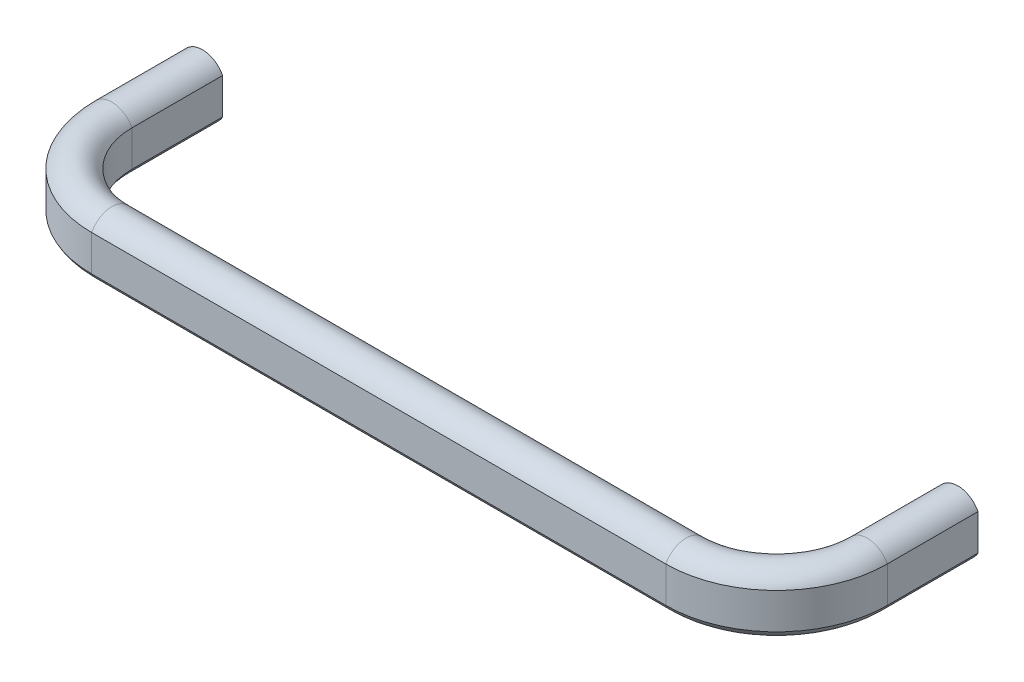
ISO-10303-21;
HEADER;
FILE_DESCRIPTION(('STEP AP214'),'2;1');
FILE_NAME('part.step','',(''),(''),'','','');
FILE_SCHEMA(('AUTOMOTIVE_DESIGN { 1 0 10303 214 1 1 1 1 }'));
ENDSEC;
DATA;
#1=APPLICATION_CONTEXT('core data for automotive mechanical design processes');
#2=APPLICATION_PROTOCOL_DEFINITION('international standard','automotive_design',2000,#1);
#3=PRODUCT_CONTEXT('',#1,'mechanical');
#4=PRODUCT('Part','Part','',(#3));
#5=PRODUCT_RELATED_PRODUCT_CATEGORY('part','',(#4));
#6=PRODUCT_DEFINITION_FORMATION('','',#4);
#7=PRODUCT_DEFINITION_CONTEXT('part definition',#1,'design');
#8=PRODUCT_DEFINITION('design','',#6,#7);
#9=PRODUCT_DEFINITION_SHAPE('','',#8);
#10=(LENGTH_UNIT() NAMED_UNIT(*) SI_UNIT(.MILLI.,.METRE.));
#11=(NAMED_UNIT(*) PLANE_ANGLE_UNIT() SI_UNIT($,.RADIAN.));
#12=(NAMED_UNIT(*) SI_UNIT($,.STERADIAN.) SOLID_ANGLE_UNIT());
#13=UNCERTAINTY_MEASURE_WITH_UNIT(LENGTH_MEASURE(1.E-05),#10,'distance_accuracy_value','');
#14=(GEOMETRIC_REPRESENTATION_CONTEXT(3) GLOBAL_UNCERTAINTY_ASSIGNED_CONTEXT((#13)) GLOBAL_UNIT_ASSIGNED_CONTEXT((#10,
#11,#12)) REPRESENTATION_CONTEXT('',''));
#15=CARTESIAN_POINT('',(0.,0.,0.));
#16=DIRECTION('',(0.,0.,1.));
#17=DIRECTION('',(1.,0.,0.));
#18=AXIS2_PLACEMENT_3D('',#15,#16,#17);
#19=CARTESIAN_POINT('',(149.999999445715,1.49999905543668,0.));
#20=DIRECTION('',(0.,0.,1.));
#21=DIRECTION('',(0.,1.,0.));
#22=AXIS2_PLACEMENT_3D('',#19,#20,#21);
#23=PLANE('',#22);
#24=CARTESIAN_POINT('',(150.,0.,0.));
#25=DIRECTION('',(0.,0.,1.));
#26=DIRECTION('',(1.,0.,0.));
#27=AXIS2_PLACEMENT_3D('',#24,#25,#26);
#28=CIRCLE('',#27,2.95);
#29=CARTESIAN_POINT('',(152.95,0.,0.));
#30=VERTEX_POINT('',#29);
#31=EDGE_CURVE('E236',#30,#30,#28,.T.);
#32=ORIENTED_EDGE('',*,*,#31,.T.);
#33=EDGE_LOOP('',(#32));
#34=FACE_BOUND('',#33,.T.);
#35=CARTESIAN_POINT('',(149.999999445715,1.49999905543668,0.));
#36=DIRECTION('',(0.,0.,1.));
#37=DIRECTION('',(0.,1.,0.));
#38=AXIS2_PLACEMENT_3D('',#35,#36,#37);
#39=CIRCLE('',#38,4.50000000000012);
#40=CARTESIAN_POINT('',(154.,3.56155079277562,0.));
#41=VERTEX_POINT('',#40);
#42=CARTESIAN_POINT('',(145.99999880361,3.56155062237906,0.));
#43=VERTEX_POINT('',#42);
#44=EDGE_CURVE('E209',#41,#43,#39,.T.);
#45=ORIENTED_EDGE('',*,*,#44,.F.);
#46=DIRECTION('',(0.,-1.,0.));
#47=VECTOR('',#46,1.);
#48=CARTESIAN_POINT('',(154.,3.56155079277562,0.));
#49=LINE('',#48,#47);
#50=CARTESIAN_POINT('',(154.,-3.56155431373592,0.));
#51=VERTEX_POINT('',#50);
#52=EDGE_CURVE('E30',#41,#51,#49,.T.);
#53=ORIENTED_EDGE('',*,*,#52,.T.);
#54=CARTESIAN_POINT('',(149.999999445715,-1.5000009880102,0.));
#55=DIRECTION('',(0.,0.,1.));
#56=DIRECTION('',(0.,1.,0.));
#57=AXIS2_PLACEMENT_3D('',#54,#55,#56);
#58=CIRCLE('',#57,4.5000001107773);
#59=CARTESIAN_POINT('',(145.999999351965,-3.56155386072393,0.));
#60=VERTEX_POINT('',#59);
#61=EDGE_CURVE('E38',#60,#51,#58,.T.);
#62=ORIENTED_EDGE('',*,*,#61,.F.);
#63=DIRECTION('',(0.,-1.,0.));
#64=VECTOR('',#63,1.);
#65=CARTESIAN_POINT('',(145.99999880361,3.56155062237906,0.));
#66=LINE('',#65,#64);
#67=EDGE_CURVE('E230',#43,#60,#66,.T.);
#68=ORIENTED_EDGE('',*,*,#67,.F.);
#69=EDGE_LOOP('',(#45,#53,#62,#68));
#70=FACE_BOUND('',#69,.T.);
#71=ADVANCED_FACE('F14',(#34,#70),#23,.F.);
#72=CARTESIAN_POINT('',(5.5428439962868E-07,1.49999905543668,0.));
#73=DIRECTION('',(0.,0.,-1.));
#74=DIRECTION('',(0.,1.,0.));
#75=AXIS2_PLACEMENT_3D('',#72,#73,#74);
#76=PLANE('',#75);
#77=CARTESIAN_POINT('',(0.,0.,0.));
#78=DIRECTION('',(0.,0.,-1.));
#79=DIRECTION('',(-1.,0.,0.));
#80=AXIS2_PLACEMENT_3D('',#77,#78,#79);
#81=CIRCLE('',#80,2.95);
#82=CARTESIAN_POINT('',(-2.95,0.,0.));
#83=VERTEX_POINT('',#82);
#84=EDGE_CURVE('E9',#83,#83,#81,.F.);
#85=ORIENTED_EDGE('',*,*,#84,.T.);
#86=EDGE_LOOP('',(#85));
#87=FACE_BOUND('',#86,.T.);
#88=CARTESIAN_POINT('',(5.5428439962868E-07,1.49999905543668,0.));
#89=DIRECTION('',(0.,0.,-1.));
#90=DIRECTION('',(0.,1.,0.));
#91=AXIS2_PLACEMENT_3D('',#88,#89,#90);
#92=CIRCLE('',#91,4.50000000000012);
#93=CARTESIAN_POINT('',(-4.,3.56155079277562,0.));
#94=VERTEX_POINT('',#93);
#95=CARTESIAN_POINT('',(4.0000011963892,3.56155062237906,0.));
#96=VERTEX_POINT('',#95);
#97=EDGE_CURVE('E107',#94,#96,#92,.T.);
#98=ORIENTED_EDGE('',*,*,#97,.T.);
#99=DIRECTION('',(0.,-1.,0.));
#100=VECTOR('',#99,1.);
#101=CARTESIAN_POINT('',(4.0000011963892,3.56155062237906,0.));
#102=LINE('',#101,#100);
#103=CARTESIAN_POINT('',(4.00000064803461,-3.56155386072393,0.));
#104=VERTEX_POINT('',#103);
#105=EDGE_CURVE('E111',#96,#104,#102,.T.);
#106=ORIENTED_EDGE('',*,*,#105,.T.);
#107=CARTESIAN_POINT('',(5.5428439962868E-07,-1.5000009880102,0.));
#108=DIRECTION('',(0.,0.,-1.));
#109=DIRECTION('',(0.,1.,0.));
#110=AXIS2_PLACEMENT_3D('',#107,#108,#109);
#111=CIRCLE('',#110,4.5000001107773);
#112=CARTESIAN_POINT('',(-4.,-3.56155431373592,0.));
#113=VERTEX_POINT('',#112);
#114=EDGE_CURVE('E132',#104,#113,#111,.T.);
#115=ORIENTED_EDGE('',*,*,#114,.T.);
#116=DIRECTION('',(0.,-1.,0.));
#117=VECTOR('',#116,1.);
#118=CARTESIAN_POINT('',(-4.,3.56155079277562,0.));
#119=LINE('',#118,#117);
#120=EDGE_CURVE('E114',#94,#113,#119,.T.);
#121=ORIENTED_EDGE('',*,*,#120,.F.);
#122=EDGE_LOOP('',(#98,#106,#115,#121));
#123=FACE_BOUND('',#122,.T.);
#124=ADVANCED_FACE('F109',(#87,#123),#76,.T.);
#125=CARTESIAN_POINT('',(154.,3.56155079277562,18.));
#126=DIRECTION('',(1.,0.,0.));
#127=DIRECTION('',(0.,0.,1.));
#128=AXIS2_PLACEMENT_3D('',#125,#126,#127);
#129=PLANE('',#128);
#130=DIRECTION('',(0.,-1.,0.));
#131=VECTOR('',#130,1.);
#132=CARTESIAN_POINT('',(154.,3.56155079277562,18.));
#133=LINE('',#132,#131);
#134=CARTESIAN_POINT('',(154.,3.56155079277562,18.));
#135=VERTEX_POINT('',#134);
#136=CARTESIAN_POINT('',(154.,-3.56155431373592,18.));
#137=VERTEX_POINT('',#136);
#138=EDGE_CURVE('E200',#135,#137,#133,.T.);
#139=ORIENTED_EDGE('',*,*,#138,.T.);
#140=DIRECTION('',(0.,0.,-1.));
#141=VECTOR('',#140,1.);
#142=CARTESIAN_POINT('',(154.,-3.56155431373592,18.));
#143=LINE('',#142,#141);
#144=EDGE_CURVE('E223',#137,#51,#143,.T.);
#145=ORIENTED_EDGE('',*,*,#144,.T.);
#146=ORIENTED_EDGE('',*,*,#52,.F.);
#147=DIRECTION('',(0.,0.,-1.));
#148=VECTOR('',#147,1.);
#149=CARTESIAN_POINT('',(154.,3.56155079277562,18.));
#150=LINE('',#149,#148);
#151=EDGE_CURVE('E225',#135,#41,#150,.T.);
#152=ORIENTED_EDGE('',*,*,#151,.F.);
#153=EDGE_LOOP('',(#139,#145,#146,#152));
#154=FACE_BOUND('',#153,.T.);
#155=ADVANCED_FACE('F262',(#154),#129,.T.);
#156=CARTESIAN_POINT('',(149.999999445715,-1.5000009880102,18.));
#157=DIRECTION('',(0.,0.,-1.));
#158=DIRECTION('',(1.,0.,0.));
#159=AXIS2_PLACEMENT_3D('',#156,#157,#158);
#160=CYLINDRICAL_SURFACE('',#159,4.5000001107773);
#161=CARTESIAN_POINT('',(149.999999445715,-1.5000009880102,18.));
#162=DIRECTION('',(0.,0.,1.));
#163=DIRECTION('',(0.,1.,0.));
#164=AXIS2_PLACEMENT_3D('',#161,#162,#163);
#165=CIRCLE('',#164,4.5000001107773);
#166=CARTESIAN_POINT('',(145.999999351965,-3.56155386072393,18.));
#167=VERTEX_POINT('',#166);
#168=EDGE_CURVE('E214',#167,#137,#165,.T.);
#169=ORIENTED_EDGE('',*,*,#168,.F.);
#170=DIRECTION('',(0.,0.,-1.));
#171=VECTOR('',#170,1.);
#172=CARTESIAN_POINT('',(145.999999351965,-3.56155386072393,18.));
#173=LINE('',#172,#171);
#174=EDGE_CURVE('E221',#167,#60,#173,.T.);
#175=ORIENTED_EDGE('',*,*,#174,.T.);
#176=ORIENTED_EDGE('',*,*,#61,.T.);
#177=ORIENTED_EDGE('',*,*,#144,.F.);
#178=EDGE_LOOP('',(#169,#175,#176,#177));
#179=FACE_BOUND('',#178,.T.);
#180=ADVANCED_FACE('F335',(#179),#160,.T.);
#181=CARTESIAN_POINT('',(145.99999880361,3.56155062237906,18.));
#182=DIRECTION('',(1.,0.,0.));
#183=DIRECTION('',(0.,0.,1.));
#184=AXIS2_PLACEMENT_3D('',#181,#182,#183);
#185=PLANE('',#184);
#186=DIRECTION('',(0.,-1.,0.));
#187=VECTOR('',#186,1.);
#188=CARTESIAN_POINT('',(145.99999880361,3.56155062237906,18.));
#189=LINE('',#188,#187);
#190=CARTESIAN_POINT('',(145.99999880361,3.56155062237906,18.));
#191=VERTEX_POINT('',#190);
#192=EDGE_CURVE('E211',#191,#167,#189,.T.);
#193=ORIENTED_EDGE('',*,*,#192,.F.);
#194=DIRECTION('',(0.,0.,-1.));
#195=VECTOR('',#194,1.);
#196=CARTESIAN_POINT('',(145.99999880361,3.56155062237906,18.));
#197=LINE('',#196,#195);
#198=EDGE_CURVE('E218',#191,#43,#197,.T.);
#199=ORIENTED_EDGE('',*,*,#198,.T.);
#200=ORIENTED_EDGE('',*,*,#67,.T.);
#201=ORIENTED_EDGE('',*,*,#174,.F.);
#202=EDGE_LOOP('',(#193,#199,#200,#201));
#203=FACE_BOUND('',#202,.T.);
#204=ADVANCED_FACE('F331',(#203),#185,.F.);
#205=CARTESIAN_POINT('',(149.999999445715,1.49999905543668,18.));
#206=DIRECTION('',(0.,0.,-1.));
#207=DIRECTION('',(1.,0.,0.));
#208=AXIS2_PLACEMENT_3D('',#205,#206,#207);
#209=CYLINDRICAL_SURFACE('',#208,4.50000000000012);
#210=CARTESIAN_POINT('',(149.999999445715,1.49999905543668,18.));
#211=DIRECTION('',(0.,0.,1.));
#212=DIRECTION('',(0.,1.,0.));
#213=AXIS2_PLACEMENT_3D('',#210,#211,#212);
#214=CIRCLE('',#213,4.50000000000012);
#215=EDGE_CURVE('E187',#135,#191,#214,.T.);
#216=ORIENTED_EDGE('',*,*,#215,.F.);
#217=ORIENTED_EDGE('',*,*,#151,.T.);
#218=ORIENTED_EDGE('',*,*,#44,.T.);
#219=ORIENTED_EDGE('',*,*,#198,.F.);
#220=EDGE_LOOP('',(#216,#217,#218,#219));
#221=FACE_BOUND('',#220,.T.);
#222=ADVANCED_FACE('F327',(#221),#209,.T.);
#223=CARTESIAN_POINT('',(132.,0.,18.));
#224=DIRECTION('',(0.,1.,0.));
#225=DIRECTION('',(-1.,0.,0.));
#226=AXIS2_PLACEMENT_3D('',#223,#224,#225);
#227=CYLINDRICAL_SURFACE('',#226,21.9999999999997);
#228=DIRECTION('',(0.,-1.,0.));
#229=VECTOR('',#228,1.);
#230=CARTESIAN_POINT('',(132.,3.56155079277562,40.));
#231=LINE('',#230,#229);
#232=CARTESIAN_POINT('',(132.,3.56155079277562,40.));
#233=VERTEX_POINT('',#232);
#234=CARTESIAN_POINT('',(132.,-3.56155431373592,40.));
#235=VERTEX_POINT('',#234);
#236=EDGE_CURVE('E178',#233,#235,#231,.T.);
#237=ORIENTED_EDGE('',*,*,#236,.T.);
#238=CARTESIAN_POINT('',(132.,-3.56155431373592,18.));
#239=DIRECTION('',(0.,1.,0.));
#240=DIRECTION('',(-1.,0.,0.));
#241=AXIS2_PLACEMENT_3D('',#238,#239,#240);
#242=CIRCLE('',#241,21.9999999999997);
#243=EDGE_CURVE('E203',#235,#137,#242,.T.);
#244=ORIENTED_EDGE('',*,*,#243,.T.);
#245=ORIENTED_EDGE('',*,*,#138,.F.);
#246=CARTESIAN_POINT('',(132.,3.56155079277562,18.));
#247=DIRECTION('',(0.,1.,0.));
#248=DIRECTION('',(-1.,0.,0.));
#249=AXIS2_PLACEMENT_3D('',#246,#247,#248);
#250=CIRCLE('',#249,21.9999999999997);
#251=EDGE_CURVE('E206',#233,#135,#250,.T.);
#252=ORIENTED_EDGE('',*,*,#251,.F.);
#253=EDGE_LOOP('',(#237,#244,#245,#252));
#254=FACE_BOUND('',#253,.T.);
#255=ADVANCED_FACE('F323',(#254),#227,.T.);
#256=CARTESIAN_POINT('',(132.,-1.5000009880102,18.));
#257=DIRECTION('',(0.,1.,0.));
#258=DIRECTION('',(-1.,0.,0.));
#259=AXIS2_PLACEMENT_3D('',#256,#257,#258);
#260=TOROIDAL_SURFACE('',#259,17.9999994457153,4.5000001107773);
#261=CARTESIAN_POINT('',(132.,-1.5000009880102,35.9999994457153));
#262=DIRECTION('',(-1.,0.,0.));
#263=DIRECTION('',(0.,1.,0.));
#264=AXIS2_PLACEMENT_3D('',#261,#262,#263);
#265=CIRCLE('',#264,4.5000001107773);
#266=CARTESIAN_POINT('',(132.,-3.56155386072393,31.9999993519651));
#267=VERTEX_POINT('',#266);
#268=EDGE_CURVE('E192',#267,#235,#265,.T.);
#269=ORIENTED_EDGE('',*,*,#268,.F.);
#270=CARTESIAN_POINT('',(132.,-3.56155386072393,18.));
#271=DIRECTION('',(0.,1.,0.));
#272=DIRECTION('',(-1.,0.,0.));
#273=AXIS2_PLACEMENT_3D('',#270,#271,#272);
#274=CIRCLE('',#273,13.999999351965);
#275=EDGE_CURVE('E199',#267,#167,#274,.T.);
#276=ORIENTED_EDGE('',*,*,#275,.T.);
#277=ORIENTED_EDGE('',*,*,#168,.T.);
#278=ORIENTED_EDGE('',*,*,#243,.F.);
#279=EDGE_LOOP('',(#269,#276,#277,#278));
#280=FACE_BOUND('',#279,.T.);
#281=ADVANCED_FACE('F319',(#280),#260,.T.);
#282=CARTESIAN_POINT('',(132.,0.,18.));
#283=DIRECTION('',(0.,1.,0.));
#284=DIRECTION('',(-1.,0.,0.));
#285=AXIS2_PLACEMENT_3D('',#282,#283,#284);
#286=CYLINDRICAL_SURFACE('',#285,13.9999990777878);
#287=DIRECTION('',(0.,-1.,0.));
#288=VECTOR('',#287,1.);
#289=CARTESIAN_POINT('',(132.,3.56155062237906,31.9999988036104));
#290=LINE('',#289,#288);
#291=CARTESIAN_POINT('',(132.,3.56155062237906,31.9999988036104));
#292=VERTEX_POINT('',#291);
#293=EDGE_CURVE('E189',#292,#267,#290,.T.);
#294=ORIENTED_EDGE('',*,*,#293,.F.);
#295=CARTESIAN_POINT('',(132.,3.56155062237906,18.));
#296=DIRECTION('',(0.,1.,0.));
#297=DIRECTION('',(-1.,0.,0.));
#298=AXIS2_PLACEMENT_3D('',#295,#296,#297);
#299=CIRCLE('',#298,13.9999988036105);
#300=EDGE_CURVE('E196',#292,#191,#299,.T.);
#301=ORIENTED_EDGE('',*,*,#300,.T.);
#302=ORIENTED_EDGE('',*,*,#192,.T.);
#303=ORIENTED_EDGE('',*,*,#275,.F.);
#304=EDGE_LOOP('',(#294,#301,#302,#303));
#305=FACE_BOUND('',#304,.T.);
#306=ADVANCED_FACE('F315',(#305),#286,.F.);
#307=CARTESIAN_POINT('',(132.,1.49999905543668,18.));
#308=DIRECTION('',(0.,1.,0.));
#309=DIRECTION('',(-1.,0.,0.));
#310=AXIS2_PLACEMENT_3D('',#307,#308,#309);
#311=TOROIDAL_SURFACE('',#310,17.9999994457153,4.50000000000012);
#312=CARTESIAN_POINT('',(132.,1.49999905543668,35.9999994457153));
#313=DIRECTION('',(-1.,0.,0.));
#314=DIRECTION('',(0.,1.,0.));
#315=AXIS2_PLACEMENT_3D('',#312,#313,#314);
#316=CIRCLE('',#315,4.50000000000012);
#317=EDGE_CURVE('E165',#233,#292,#316,.T.);
#318=ORIENTED_EDGE('',*,*,#317,.F.);
#319=ORIENTED_EDGE('',*,*,#251,.T.);
#320=ORIENTED_EDGE('',*,*,#215,.T.);
#321=ORIENTED_EDGE('',*,*,#300,.F.);
#322=EDGE_LOOP('',(#318,#319,#320,#321));
#323=FACE_BOUND('',#322,.T.);
#324=ADVANCED_FACE('F311',(#323),#311,.T.);
#325=CARTESIAN_POINT('',(17.9999999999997,3.56155079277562,40.));
#326=DIRECTION('',(0.,0.,1.));
#327=DIRECTION('',(-1.,0.,0.));
#328=AXIS2_PLACEMENT_3D('',#325,#326,#327);
#329=PLANE('',#328);
#330=DIRECTION('',(0.,-1.,0.));
#331=VECTOR('',#330,1.);
#332=CARTESIAN_POINT('',(17.9999999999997,3.56155079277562,40.));
#333=LINE('',#332,#331);
#334=CARTESIAN_POINT('',(17.9999999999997,3.56155079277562,40.));
#335=VERTEX_POINT('',#334);
#336=CARTESIAN_POINT('',(17.9999999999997,-3.56155431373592,40.));
#337=VERTEX_POINT('',#336);
#338=EDGE_CURVE('E156',#335,#337,#333,.T.);
#339=ORIENTED_EDGE('',*,*,#338,.T.);
#340=DIRECTION('',(1.,0.,0.));
#341=VECTOR('',#340,1.);
#342=CARTESIAN_POINT('',(17.9999999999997,-3.56155431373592,40.));
#343=LINE('',#342,#341);
#344=EDGE_CURVE('E181',#337,#235,#343,.T.);
#345=ORIENTED_EDGE('',*,*,#344,.T.);
#346=ORIENTED_EDGE('',*,*,#236,.F.);
#347=DIRECTION('',(1.,0.,0.));
#348=VECTOR('',#347,1.);
#349=CARTESIAN_POINT('',(17.9999999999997,3.56155079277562,40.));
#350=LINE('',#349,#348);
#351=EDGE_CURVE('E184',#335,#233,#350,.T.);
#352=ORIENTED_EDGE('',*,*,#351,.F.);
#353=EDGE_LOOP('',(#339,#345,#346,#352));
#354=FACE_BOUND('',#353,.T.);
#355=ADVANCED_FACE('F307',(#354),#329,.T.);
#356=CARTESIAN_POINT('',(17.9999999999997,-1.5000009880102,35.9999994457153));
#357=DIRECTION('',(1.,0.,0.));
#358=DIRECTION('',(0.,0.,1.));
#359=AXIS2_PLACEMENT_3D('',#356,#357,#358);
#360=CYLINDRICAL_SURFACE('',#359,4.5000001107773);
#361=CARTESIAN_POINT('',(17.9999999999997,-1.5000009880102,35.9999994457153));
#362=DIRECTION('',(-1.,0.,0.));
#363=DIRECTION('',(0.,1.,0.));
#364=AXIS2_PLACEMENT_3D('',#361,#362,#363);
#365=CIRCLE('',#364,4.5000001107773);
#366=CARTESIAN_POINT('',(17.9999999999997,-3.56155386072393,31.9999993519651));
#367=VERTEX_POINT('',#366);
#368=EDGE_CURVE('E170',#367,#337,#365,.T.);
#369=ORIENTED_EDGE('',*,*,#368,.F.);
#370=DIRECTION('',(1.,0.,0.));
#371=VECTOR('',#370,1.);
#372=CARTESIAN_POINT('',(17.9999999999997,-3.56155386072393,31.9999993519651));
#373=LINE('',#372,#371);
#374=EDGE_CURVE('E177',#367,#267,#373,.T.);
#375=ORIENTED_EDGE('',*,*,#374,.T.);
#376=ORIENTED_EDGE('',*,*,#268,.T.);
#377=ORIENTED_EDGE('',*,*,#344,.F.);
#378=EDGE_LOOP('',(#369,#375,#376,#377));
#379=FACE_BOUND('',#378,.T.);
#380=ADVANCED_FACE('F303',(#379),#360,.T.);
#381=CARTESIAN_POINT('',(17.9999999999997,3.56155062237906,31.9999988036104));
#382=DIRECTION('',(0.,0.,1.));
#383=DIRECTION('',(-1.,0.,0.));
#384=AXIS2_PLACEMENT_3D('',#381,#382,#383);
#385=PLANE('',#384);
#386=DIRECTION('',(0.,-1.,0.));
#387=VECTOR('',#386,1.);
#388=CARTESIAN_POINT('',(17.9999999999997,3.56155062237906,31.9999988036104));
#389=LINE('',#388,#387);
#390=CARTESIAN_POINT('',(17.9999999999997,3.56155062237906,31.9999988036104));
#391=VERTEX_POINT('',#390);
#392=EDGE_CURVE('E167',#391,#367,#389,.T.);
#393=ORIENTED_EDGE('',*,*,#392,.F.);
#394=DIRECTION('',(1.,0.,0.));
#395=VECTOR('',#394,1.);
#396=CARTESIAN_POINT('',(17.9999999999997,3.56155062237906,31.9999988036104));
#397=LINE('',#396,#395);
#398=EDGE_CURVE('E174',#391,#292,#397,.T.);
#399=ORIENTED_EDGE('',*,*,#398,.T.);
#400=ORIENTED_EDGE('',*,*,#293,.T.);
#401=ORIENTED_EDGE('',*,*,#374,.F.);
#402=EDGE_LOOP('',(#393,#399,#400,#401));
#403=FACE_BOUND('',#402,.T.);
#404=ADVANCED_FACE('F299',(#403),#385,.F.);
#405=CARTESIAN_POINT('',(17.9999999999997,1.49999905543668,35.9999994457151));
#406=DIRECTION('',(1.,0.,0.));
#407=DIRECTION('',(0.,0.,1.));
#408=AXIS2_PLACEMENT_3D('',#405,#406,#407);
#409=CYLINDRICAL_SURFACE('',#408,4.50000000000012);
#410=CARTESIAN_POINT('',(17.9999999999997,1.49999905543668,35.9999994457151));
#411=DIRECTION('',(-1.,0.,0.));
#412=DIRECTION('',(0.,1.,0.));
#413=AXIS2_PLACEMENT_3D('',#410,#411,#412);
#414=CIRCLE('',#413,4.50000000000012);
#415=EDGE_CURVE('E151',#335,#391,#414,.T.);
#416=ORIENTED_EDGE('',*,*,#415,.F.);
#417=ORIENTED_EDGE('',*,*,#351,.T.);
#418=ORIENTED_EDGE('',*,*,#317,.T.);
#419=ORIENTED_EDGE('',*,*,#398,.F.);
#420=EDGE_LOOP('',(#416,#417,#418,#419));
#421=FACE_BOUND('',#420,.T.);
#422=ADVANCED_FACE('F295',(#421),#409,.T.);
#423=CARTESIAN_POINT('',(17.9999999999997,0.,18.));
#424=DIRECTION('',(0.,1.,0.));
#425=DIRECTION('',(-1.,0.,0.));
#426=AXIS2_PLACEMENT_3D('',#423,#424,#425);
#427=CYLINDRICAL_SURFACE('',#426,21.9999999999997);
#428=DIRECTION('',(0.,-1.,0.));
#429=VECTOR('',#428,1.);
#430=CARTESIAN_POINT('',(-4.,3.56155079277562,18.));
#431=LINE('',#430,#429);
#432=CARTESIAN_POINT('',(-4.,3.56155079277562,18.));
#433=VERTEX_POINT('',#432);
#434=CARTESIAN_POINT('',(-4.,-3.56155431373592,18.));
#435=VERTEX_POINT('',#434);
#436=EDGE_CURVE('E128',#433,#435,#431,.T.);
#437=ORIENTED_EDGE('',*,*,#436,.T.);
#438=CARTESIAN_POINT('',(17.9999999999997,-3.56155431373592,18.));
#439=DIRECTION('',(0.,1.,0.));
#440=DIRECTION('',(-1.,0.,0.));
#441=AXIS2_PLACEMENT_3D('',#438,#439,#440);
#442=CIRCLE('',#441,21.9999999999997);
#443=EDGE_CURVE('E159',#435,#337,#442,.T.);
#444=ORIENTED_EDGE('',*,*,#443,.T.);
#445=ORIENTED_EDGE('',*,*,#338,.F.);
#446=CARTESIAN_POINT('',(17.9999999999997,3.56155079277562,18.));
#447=DIRECTION('',(0.,1.,0.));
#448=DIRECTION('',(-1.,0.,0.));
#449=AXIS2_PLACEMENT_3D('',#446,#447,#448);
#450=CIRCLE('',#449,21.9999999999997);
#451=EDGE_CURVE('E162',#433,#335,#450,.T.);
#452=ORIENTED_EDGE('',*,*,#451,.F.);
#453=EDGE_LOOP('',(#437,#444,#445,#452));
#454=FACE_BOUND('',#453,.T.);
#455=ADVANCED_FACE('F291',(#454),#427,.T.);
#456=CARTESIAN_POINT('',(17.9999999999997,-1.5000009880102,18.));
#457=DIRECTION('',(0.,1.,0.));
#458=DIRECTION('',(-1.,0.,0.));
#459=AXIS2_PLACEMENT_3D('',#456,#457,#458);
#460=TOROIDAL_SURFACE('',#459,17.9999994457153,4.5000001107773);
#461=CARTESIAN_POINT('',(5.5428439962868E-07,-1.5000009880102,18.));
#462=DIRECTION('',(0.,0.,-1.));
#463=DIRECTION('',(0.,1.,0.));
#464=AXIS2_PLACEMENT_3D('',#461,#462,#463);
#465=CIRCLE('',#464,4.5000001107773);
#466=CARTESIAN_POINT('',(4.00000064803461,-3.56155386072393,18.));
#467=VERTEX_POINT('',#466);
#468=EDGE_CURVE('E141',#467,#435,#465,.T.);
#469=ORIENTED_EDGE('',*,*,#468,.F.);
#470=CARTESIAN_POINT('',(17.9999999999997,-3.56155386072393,18.));
#471=DIRECTION('',(0.,1.,0.));
#472=DIRECTION('',(-1.,0.,0.));
#473=AXIS2_PLACEMENT_3D('',#470,#471,#472);
#474=CIRCLE('',#473,13.9999993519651);
#475=EDGE_CURVE('E155',#467,#367,#474,.T.);
#476=ORIENTED_EDGE('',*,*,#475,.T.);
#477=ORIENTED_EDGE('',*,*,#368,.T.);
#478=ORIENTED_EDGE('',*,*,#443,.F.);
#479=EDGE_LOOP('',(#469,#476,#477,#478));
#480=FACE_BOUND('',#479,.T.);
#481=ADVANCED_FACE('F287',(#480),#460,.T.);
#482=CARTESIAN_POINT('',(17.9999999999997,0.,18.));
#483=DIRECTION('',(0.,1.,0.));
#484=DIRECTION('',(-1.,0.,0.));
#485=AXIS2_PLACEMENT_3D('',#482,#483,#484);
#486=CYLINDRICAL_SURFACE('',#485,13.9999990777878);
#487=DIRECTION('',(0.,-1.,0.));
#488=VECTOR('',#487,1.);
#489=CARTESIAN_POINT('',(4.0000011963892,3.56155062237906,18.));
#490=LINE('',#489,#488);
#491=CARTESIAN_POINT('',(4.0000011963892,3.56155062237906,18.));
#492=VERTEX_POINT('',#491);
#493=EDGE_CURVE('E139',#492,#467,#490,.T.);
#494=ORIENTED_EDGE('',*,*,#493,.F.);
#495=CARTESIAN_POINT('',(17.9999999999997,3.56155062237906,18.));
#496=DIRECTION('',(0.,1.,0.));
#497=DIRECTION('',(-1.,0.,0.));
#498=AXIS2_PLACEMENT_3D('',#495,#496,#497);
#499=CIRCLE('',#498,13.9999988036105);
#500=EDGE_CURVE('E152',#492,#391,#499,.T.);
#501=ORIENTED_EDGE('',*,*,#500,.T.);
#502=ORIENTED_EDGE('',*,*,#392,.T.);
#503=ORIENTED_EDGE('',*,*,#475,.F.);
#504=EDGE_LOOP('',(#494,#501,#502,#503));
#505=FACE_BOUND('',#504,.T.);
#506=ADVANCED_FACE('F283',(#505),#486,.F.);
#507=CARTESIAN_POINT('',(17.9999999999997,1.49999905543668,18.));
#508=DIRECTION('',(0.,1.,0.));
#509=DIRECTION('',(-1.,0.,0.));
#510=AXIS2_PLACEMENT_3D('',#507,#508,#509);
#511=TOROIDAL_SURFACE('',#510,17.9999994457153,4.50000000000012);
#512=CARTESIAN_POINT('',(5.5428439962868E-07,1.49999905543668,18.));
#513=DIRECTION('',(0.,0.,-1.));
#514=DIRECTION('',(0.,1.,0.));
#515=AXIS2_PLACEMENT_3D('',#512,#513,#514);
#516=CIRCLE('',#515,4.50000000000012);
#517=EDGE_CURVE('E123',#433,#492,#516,.T.);
#518=ORIENTED_EDGE('',*,*,#517,.F.);
#519=ORIENTED_EDGE('',*,*,#451,.T.);
#520=ORIENTED_EDGE('',*,*,#415,.T.);
#521=ORIENTED_EDGE('',*,*,#500,.F.);
#522=EDGE_LOOP('',(#518,#519,#520,#521));
#523=FACE_BOUND('',#522,.T.);
#524=ADVANCED_FACE('F279',(#523),#511,.T.);
#525=CARTESIAN_POINT('',(-4.,3.56155079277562,18.));
#526=DIRECTION('',(1.,0.,0.));
#527=DIRECTION('',(0.,1.,0.));
#528=AXIS2_PLACEMENT_3D('',#525,#526,#527);
#529=PLANE('',#528);
#530=DIRECTION('',(0.,0.,-1.));
#531=VECTOR('',#530,1.);
#532=CARTESIAN_POINT('',(-4.,-3.56155431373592,18.));
#533=LINE('',#532,#531);
#534=EDGE_CURVE('E146',#435,#113,#533,.T.);
#535=ORIENTED_EDGE('',*,*,#534,.F.);
#536=ORIENTED_EDGE('',*,*,#436,.F.);
#537=DIRECTION('',(0.,0.,-1.));
#538=VECTOR('',#537,1.);
#539=CARTESIAN_POINT('',(-4.,3.56155079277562,18.));
#540=LINE('',#539,#538);
#541=EDGE_CURVE('E149',#433,#94,#540,.T.);
#542=ORIENTED_EDGE('',*,*,#541,.T.);
#543=ORIENTED_EDGE('',*,*,#120,.T.);
#544=EDGE_LOOP('',(#535,#536,#542,#543));
#545=FACE_BOUND('',#544,.T.);
#546=ADVANCED_FACE('F275',(#545),#529,.F.);
#547=CARTESIAN_POINT('',(5.5428439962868E-07,-1.5000009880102,18.));
#548=DIRECTION('',(0.,0.,-1.));
#549=DIRECTION('',(0.,1.,0.));
#550=AXIS2_PLACEMENT_3D('',#547,#548,#549);
#551=CYLINDRICAL_SURFACE('',#550,4.5000001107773);
#552=DIRECTION('',(0.,0.,-1.));
#553=VECTOR('',#552,1.);
#554=CARTESIAN_POINT('',(4.00000064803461,-3.56155386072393,18.));
#555=LINE('',#554,#553);
#556=EDGE_CURVE('E127',#467,#104,#555,.T.);
#557=ORIENTED_EDGE('',*,*,#556,.F.);
#558=ORIENTED_EDGE('',*,*,#468,.T.);
#559=ORIENTED_EDGE('',*,*,#534,.T.);
#560=ORIENTED_EDGE('',*,*,#114,.F.);
#561=EDGE_LOOP('',(#557,#558,#559,#560));
#562=FACE_BOUND('',#561,.T.);
#563=ADVANCED_FACE('F272',(#562),#551,.T.);
#564=CARTESIAN_POINT('',(4.0000011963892,3.56155062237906,18.));
#565=DIRECTION('',(1.,0.,0.));
#566=DIRECTION('',(0.,1.,0.));
#567=AXIS2_PLACEMENT_3D('',#564,#565,#566);
#568=PLANE('',#567);
#569=DIRECTION('',(0.,0.,-1.));
#570=VECTOR('',#569,1.);
#571=CARTESIAN_POINT('',(4.0000011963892,3.56155062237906,18.));
#572=LINE('',#571,#570);
#573=EDGE_CURVE('E120',#492,#96,#572,.T.);
#574=ORIENTED_EDGE('',*,*,#573,.F.);
#575=ORIENTED_EDGE('',*,*,#493,.T.);
#576=ORIENTED_EDGE('',*,*,#556,.T.);
#577=ORIENTED_EDGE('',*,*,#105,.F.);
#578=EDGE_LOOP('',(#574,#575,#576,#577));
#579=FACE_BOUND('',#578,.T.);
#580=ADVANCED_FACE('F130',(#579),#568,.T.);
#581=CARTESIAN_POINT('',(5.5428439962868E-07,1.49999905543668,18.));
#582=DIRECTION('',(0.,0.,-1.));
#583=DIRECTION('',(0.,1.,0.));
#584=AXIS2_PLACEMENT_3D('',#581,#582,#583);
#585=CYLINDRICAL_SURFACE('',#584,4.50000000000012);
#586=ORIENTED_EDGE('',*,*,#517,.T.);
#587=ORIENTED_EDGE('',*,*,#573,.T.);
#588=ORIENTED_EDGE('',*,*,#97,.F.);
#589=ORIENTED_EDGE('',*,*,#541,.F.);
#590=EDGE_LOOP('',(#586,#587,#588,#589));
#591=FACE_BOUND('',#590,.T.);
#592=ADVANCED_FACE('F121',(#591),#585,.T.);
#593=CARTESIAN_POINT('',(0.,0.,10.));
#594=DIRECTION('',(0.,0.,-1.));
#595=DIRECTION('',(-1.,0.,0.));
#596=AXIS2_PLACEMENT_3D('',#593,#594,#595);
#597=CYLINDRICAL_SURFACE('',#596,2.5);
#598=CARTESIAN_POINT('',(0.,0.,0.450000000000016));
#599=DIRECTION('',(0.,0.,-1.));
#600=DIRECTION('',(-1.,0.,0.));
#601=AXIS2_PLACEMENT_3D('',#598,#599,#600);
#602=CIRCLE('',#601,2.5);
#603=CARTESIAN_POINT('',(-2.5,0.,0.450000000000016));
#604=VERTEX_POINT('',#603);
#605=EDGE_CURVE('E23',#604,#604,#602,.T.);
#606=ORIENTED_EDGE('',*,*,#605,.T.);
#607=EDGE_LOOP('',(#606));
#608=FACE_BOUND('',#607,.T.);
#609=CARTESIAN_POINT('',(0.,0.,10.));
#610=DIRECTION('',(0.,0.,-1.));
#611=DIRECTION('',(-1.,0.,0.));
#612=AXIS2_PLACEMENT_3D('',#609,#610,#611);
#613=CIRCLE('',#612,2.5);
#614=CARTESIAN_POINT('',(-2.5,0.,10.));
#615=VERTEX_POINT('',#614);
#616=EDGE_CURVE('E117',#615,#615,#613,.T.);
#617=ORIENTED_EDGE('',*,*,#616,.F.);
#618=EDGE_LOOP('',(#617));
#619=FACE_BOUND('',#618,.T.);
#620=ADVANCED_FACE('F241',(#608,#619),#597,.F.);
#621=CARTESIAN_POINT('',(0.,0.,10.));
#622=DIRECTION('',(0.,0.,-1.));
#623=DIRECTION('',(-1.,0.,0.));
#624=AXIS2_PLACEMENT_3D('',#621,#622,#623);
#625=PLANE('',#624);
#626=ORIENTED_EDGE('',*,*,#616,.T.);
#627=EDGE_LOOP('',(#626));
#628=FACE_BOUND('',#627,.T.);
#629=ADVANCED_FACE('F482',(#628),#625,.T.);
#630=CARTESIAN_POINT('',(150.,0.,10.));
#631=DIRECTION('',(0.,0.,-1.));
#632=DIRECTION('',(-1.,0.,0.));
#633=AXIS2_PLACEMENT_3D('',#630,#631,#632);
#634=CYLINDRICAL_SURFACE('',#633,2.5);
#635=CARTESIAN_POINT('',(150.,0.,0.450000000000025));
#636=DIRECTION('',(0.,0.,1.));
#637=DIRECTION('',(1.,0.,0.));
#638=AXIS2_PLACEMENT_3D('',#635,#636,#637);
#639=CIRCLE('',#638,2.5);
#640=CARTESIAN_POINT('',(152.5,0.,0.450000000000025));
#641=VERTEX_POINT('',#640);
#642=EDGE_CURVE('E228',#641,#641,#639,.F.);
#643=ORIENTED_EDGE('',*,*,#642,.T.);
#644=EDGE_LOOP('',(#643));
#645=FACE_BOUND('',#644,.T.);
#646=CARTESIAN_POINT('',(150.,0.,10.));
#647=DIRECTION('',(0.,0.,-1.));
#648=DIRECTION('',(-1.,0.,0.));
#649=AXIS2_PLACEMENT_3D('',#646,#647,#648);
#650=CIRCLE('',#649,2.5);
#651=CARTESIAN_POINT('',(147.5,0.,10.));
#652=VERTEX_POINT('',#651);
#653=EDGE_CURVE('E554',#652,#652,#650,.T.);
#654=ORIENTED_EDGE('',*,*,#653,.F.);
#655=EDGE_LOOP('',(#654));
#656=FACE_BOUND('',#655,.T.);
#657=ADVANCED_FACE('F490',(#645,#656),#634,.F.);
#658=CARTESIAN_POINT('',(150.,0.,10.));
#659=DIRECTION('',(0.,0.,-1.));
#660=DIRECTION('',(-1.,0.,0.));
#661=AXIS2_PLACEMENT_3D('',#658,#659,#660);
#662=PLANE('',#661);
#663=ORIENTED_EDGE('',*,*,#653,.T.);
#664=EDGE_LOOP('',(#663));
#665=FACE_BOUND('',#664,.T.);
#666=ADVANCED_FACE('F252',(#665),#662,.T.);
#667=CARTESIAN_POINT('',(150.,0.,0.450000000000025));
#668=DIRECTION('',(0.,0.,-1.));
#669=DIRECTION('',(-1.,0.,0.));
#670=AXIS2_PLACEMENT_3D('',#667,#668,#669);
#671=CONICAL_SURFACE('',#670,2.5,0.785398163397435);
#672=ORIENTED_EDGE('',*,*,#31,.F.);
#673=EDGE_LOOP('',(#672));
#674=FACE_BOUND('',#673,.T.);
#675=ORIENTED_EDGE('',*,*,#642,.F.);
#676=EDGE_LOOP('',(#675));
#677=FACE_BOUND('',#676,.T.);
#678=ADVANCED_FACE('F245',(#674,#677),#671,.F.);
#679=CARTESIAN_POINT('',(0.,0.,0.450000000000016));
#680=DIRECTION('',(0.,0.,-1.));
#681=DIRECTION('',(-1.,0.,0.));
#682=AXIS2_PLACEMENT_3D('',#679,#680,#681);
#683=CONICAL_SURFACE('',#682,2.5,0.785398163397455);
#684=ORIENTED_EDGE('',*,*,#84,.F.);
#685=EDGE_LOOP('',(#684));
#686=FACE_BOUND('',#685,.T.);
#687=ORIENTED_EDGE('',*,*,#605,.F.);
#688=EDGE_LOOP('',(#687));
#689=FACE_BOUND('',#688,.T.);
#690=ADVANCED_FACE('F17',(#686,#689),#683,.F.);
#691=CLOSED_SHELL('',(#71,#124,#155,#180,#204,#222,#255,#281,#306,#324,#355,#380,#404,#422,#455,
#481,#506,#524,#546,#563,#580,#592,#620,#629,#657,#666,#678,#690));
#692=MANIFOLD_SOLID_BREP('B1',#691);
#693=ADVANCED_BREP_SHAPE_REPRESENTATION('',(#18,#692),#14);
#694=SHAPE_DEFINITION_REPRESENTATION(#9,#693);
ENDSEC;
END-ISO-10303-21;
